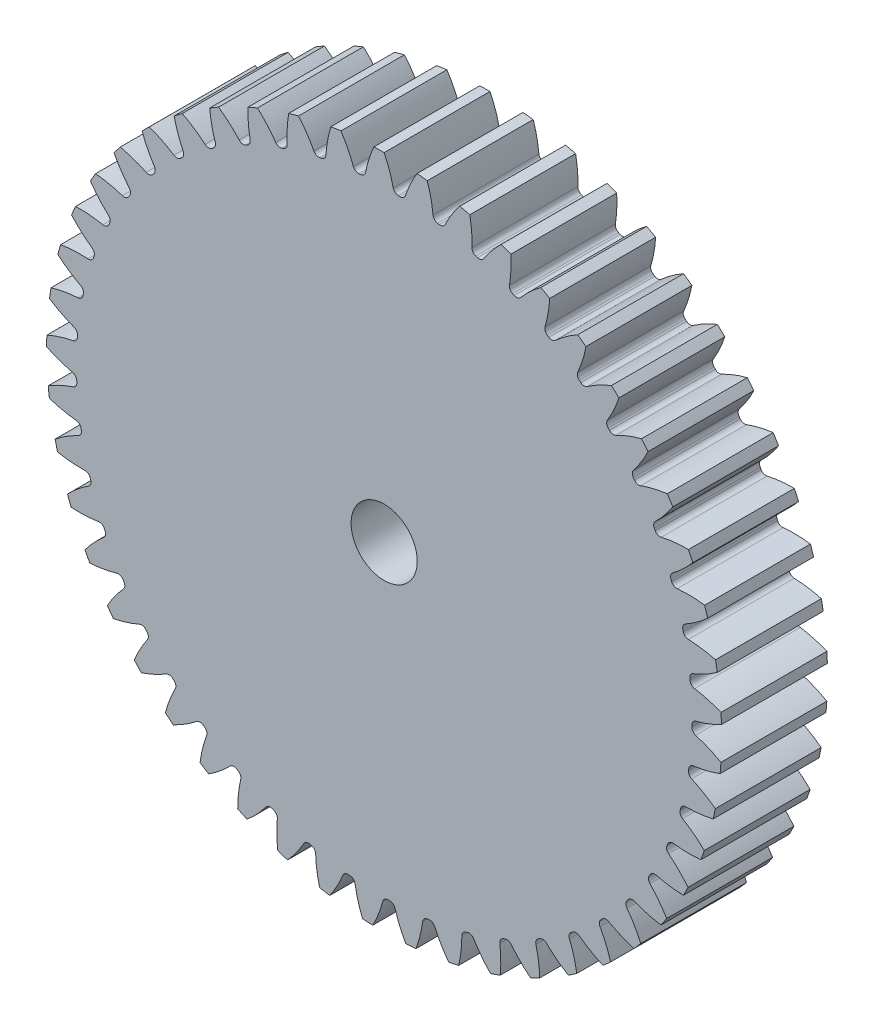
from build123d import *

# Parameters (mm, degrees)
SKETCH3_R         = 323.85
GEARBODY_DEPTH    = 101.6
TOOTHCUT_DEPTH    = 470.127067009
CIRPATTERN1_COUNT = 49
BOREDIA_R         = 31.75
BORE_DEPTH        = 12700


with BuildPart() as part:
    # Sketch3 → gearBody (new body)
    with BuildSketch(Plane.XY):
        Circle(SKETCH3_R)
    extrude(amount=GEARBODY_DEPTH)

    # Sketch2 → toothCut (cut, through all)
    with BuildSketch(Plane.XY):
        with BuildLine():
            ThreePointArc((295.216786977, -5.862961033), (295.233125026, -4.972676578), (295.246778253, -4.082346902))
            ThreePointArc((295.246778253, -4.082346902), (296.346619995, -0.965658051), (299.109885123, 0.847562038))
            ThreePointArc((299.109885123, 0.847562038), (311.759361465, 4.945003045), (323.85, 10.478061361))
            ThreePointArc((323.85, 10.478061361), (323.973511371, -5.456757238), (323.313434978, -21.378377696))
            ThreePointArc((323.313434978, -21.378377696), (311.41599076, -15.441282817), (298.911678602, -10.920171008))
            ThreePointArc((298.911678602, -10.920171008), (296.211044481, -9.01492126), (295.216786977, -5.862961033))
        make_face()
    toothcut = extrude(amount=TOOTHCUT_DEPTH, mode=Mode.SUBTRACT)

    # CirPattern1: toothCut ×49 about axis
    cirpattern1_axis = Axis((0, 0, 0), (0, 0, 1))
    for i in range(1, CIRPATTERN1_COUNT):
        add(toothcut.rotate(cirpattern1_axis, i * 360 / CIRPATTERN1_COUNT), mode=Mode.SUBTRACT)

    # boreDia → bore (cut, symmetric)
    with BuildSketch(Plane.XY):
        Circle(BOREDIA_R)
    extrude(amount=BORE_DEPTH, both=True, mode=Mode.SUBTRACT)


solid = part.part
